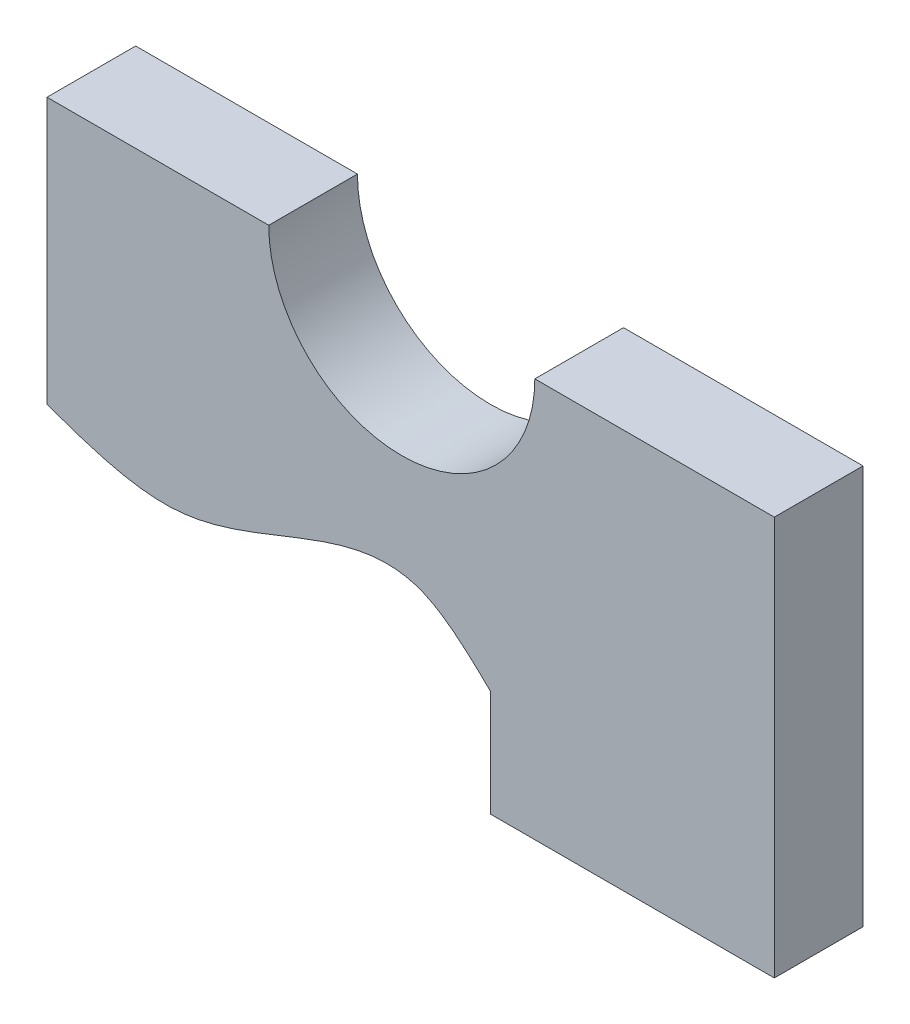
ISO-10303-21;
HEADER;
FILE_DESCRIPTION(('STEP AP214'),'2;1');
FILE_NAME('part.step','',(''),(''),'','','');
FILE_SCHEMA(('AUTOMOTIVE_DESIGN { 1 0 10303 214 1 1 1 1 }'));
ENDSEC;
DATA;
#1=APPLICATION_CONTEXT('core data for automotive mechanical design processes');
#2=APPLICATION_PROTOCOL_DEFINITION('international standard','automotive_design',2000,#1);
#3=PRODUCT_CONTEXT('',#1,'mechanical');
#4=PRODUCT('Part','Part','',(#3));
#5=PRODUCT_RELATED_PRODUCT_CATEGORY('part','',(#4));
#6=PRODUCT_DEFINITION_FORMATION('','',#4);
#7=PRODUCT_DEFINITION_CONTEXT('part definition',#1,'design');
#8=PRODUCT_DEFINITION('design','',#6,#7);
#9=PRODUCT_DEFINITION_SHAPE('','',#8);
#10=(LENGTH_UNIT() NAMED_UNIT(*) SI_UNIT(.MILLI.,.METRE.));
#11=(NAMED_UNIT(*) PLANE_ANGLE_UNIT() SI_UNIT($,.RADIAN.));
#12=(NAMED_UNIT(*) SI_UNIT($,.STERADIAN.) SOLID_ANGLE_UNIT());
#13=UNCERTAINTY_MEASURE_WITH_UNIT(LENGTH_MEASURE(1.E-05),#10,'distance_accuracy_value','');
#14=(GEOMETRIC_REPRESENTATION_CONTEXT(3) GLOBAL_UNCERTAINTY_ASSIGNED_CONTEXT((#13)) GLOBAL_UNIT_ASSIGNED_CONTEXT((#10,
#11,#12)) REPRESENTATION_CONTEXT('',''));
#15=CARTESIAN_POINT('',(0.,0.,0.));
#16=DIRECTION('',(0.,0.,1.));
#17=DIRECTION('',(1.,0.,0.));
#18=AXIS2_PLACEMENT_3D('',#15,#16,#17);
#19=CARTESIAN_POINT('',(0.,0.,10.));
#20=DIRECTION('',(1.,0.,0.));
#21=DIRECTION('',(0.,0.,-1.));
#22=AXIS2_PLACEMENT_3D('',#19,#20,#21);
#23=PLANE('',#22);
#24=DIRECTION('',(0.,-1.,0.));
#25=VECTOR('',#24,1.);
#26=CARTESIAN_POINT('',(0.,0.,0.));
#27=LINE('',#26,#25);
#28=CARTESIAN_POINT('',(0.,12.,0.));
#29=VERTEX_POINT('',#28);
#30=CARTESIAN_POINT('',(0.,0.,0.));
#31=VERTEX_POINT('',#30);
#32=EDGE_CURVE('E101',#29,#31,#27,.T.);
#33=ORIENTED_EDGE('',*,*,#32,.T.);
#34=DIRECTION('',(0.,0.,-1.));
#35=VECTOR('',#34,1.);
#36=CARTESIAN_POINT('',(0.,0.,10.));
#37=LINE('',#36,#35);
#38=CARTESIAN_POINT('',(0.,0.,10.));
#39=VERTEX_POINT('',#38);
#40=EDGE_CURVE('E11',#39,#31,#37,.T.);
#41=ORIENTED_EDGE('',*,*,#40,.F.);
#42=DIRECTION('',(0.,-1.,0.));
#43=VECTOR('',#42,1.);
#44=CARTESIAN_POINT('',(0.,0.,10.));
#45=LINE('',#44,#43);
#46=CARTESIAN_POINT('',(0.,12.,10.));
#47=VERTEX_POINT('',#46);
#48=EDGE_CURVE('E130',#47,#39,#45,.T.);
#49=ORIENTED_EDGE('',*,*,#48,.F.);
#50=DIRECTION('',(0.,0.,-1.));
#51=VECTOR('',#50,1.);
#52=CARTESIAN_POINT('',(0.,12.,10.));
#53=LINE('',#52,#51);
#54=EDGE_CURVE('E114',#47,#29,#53,.T.);
#55=ORIENTED_EDGE('',*,*,#54,.T.);
#56=EDGE_LOOP('',(#33,#41,#49,#55));
#57=FACE_BOUND('',#56,.T.);
#58=ADVANCED_FACE('F33',(#57),#23,.F.);
#59=CARTESIAN_POINT('',(0.,0.,10.));
#60=DIRECTION('',(0.,1.,0.));
#61=DIRECTION('',(0.,0.,1.));
#62=AXIS2_PLACEMENT_3D('',#59,#60,#61);
#63=PLANE('',#62);
#64=DIRECTION('',(1.,0.,0.));
#65=VECTOR('',#64,1.);
#66=CARTESIAN_POINT('',(0.,0.,0.));
#67=LINE('',#66,#65);
#68=CARTESIAN_POINT('',(32.,0.,0.));
#69=VERTEX_POINT('',#68);
#70=EDGE_CURVE('E97',#31,#69,#67,.T.);
#71=ORIENTED_EDGE('',*,*,#70,.T.);
#72=DIRECTION('',(0.,0.,-1.));
#73=VECTOR('',#72,1.);
#74=CARTESIAN_POINT('',(32.,0.,10.));
#75=LINE('',#74,#73);
#76=CARTESIAN_POINT('',(32.,0.,10.));
#77=VERTEX_POINT('',#76);
#78=EDGE_CURVE('E40',#77,#69,#75,.T.);
#79=ORIENTED_EDGE('',*,*,#78,.F.);
#80=DIRECTION('',(1.,0.,0.));
#81=VECTOR('',#80,1.);
#82=CARTESIAN_POINT('',(0.,0.,10.));
#83=LINE('',#82,#81);
#84=EDGE_CURVE('E110',#39,#77,#83,.T.);
#85=ORIENTED_EDGE('',*,*,#84,.F.);
#86=ORIENTED_EDGE('',*,*,#40,.T.);
#87=EDGE_LOOP('',(#71,#79,#85,#86));
#88=FACE_BOUND('',#87,.T.);
#89=ADVANCED_FACE('F109',(#88),#63,.F.);
#90=CARTESIAN_POINT('',(32.,45.,10.));
#91=DIRECTION('',(-1.,0.,0.));
#92=DIRECTION('',(0.,-1.,0.));
#93=AXIS2_PLACEMENT_3D('',#90,#91,#92);
#94=PLANE('',#93);
#95=DIRECTION('',(0.,1.,0.));
#96=VECTOR('',#95,1.);
#97=CARTESIAN_POINT('',(32.,45.,0.));
#98=LINE('',#97,#96);
#99=CARTESIAN_POINT('',(32.,45.,0.));
#100=VERTEX_POINT('',#99);
#101=EDGE_CURVE('E103',#69,#100,#98,.T.);
#102=ORIENTED_EDGE('',*,*,#101,.T.);
#103=DIRECTION('',(0.,0.,-1.));
#104=VECTOR('',#103,1.);
#105=CARTESIAN_POINT('',(32.,45.,10.));
#106=LINE('',#105,#104);
#107=CARTESIAN_POINT('',(32.,45.,10.));
#108=VERTEX_POINT('',#107);
#109=EDGE_CURVE('E246',#108,#100,#106,.T.);
#110=ORIENTED_EDGE('',*,*,#109,.F.);
#111=DIRECTION('',(0.,1.,0.));
#112=VECTOR('',#111,1.);
#113=CARTESIAN_POINT('',(32.,45.,10.));
#114=LINE('',#113,#112);
#115=EDGE_CURVE('E136',#77,#108,#114,.T.);
#116=ORIENTED_EDGE('',*,*,#115,.F.);
#117=ORIENTED_EDGE('',*,*,#78,.T.);
#118=EDGE_LOOP('',(#102,#110,#116,#117));
#119=FACE_BOUND('',#118,.T.);
#120=ADVANCED_FACE('F176',(#119),#94,.F.);
#121=CARTESIAN_POINT('',(4.99999999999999,45.,10.));
#122=DIRECTION('',(0.,-1.,0.));
#123=DIRECTION('',(0.,0.,-1.));
#124=AXIS2_PLACEMENT_3D('',#121,#122,#123);
#125=PLANE('',#124);
#126=DIRECTION('',(-1.,0.,0.));
#127=VECTOR('',#126,1.);
#128=CARTESIAN_POINT('',(4.99999999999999,45.,0.));
#129=LINE('',#128,#127);
#130=CARTESIAN_POINT('',(4.99999999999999,45.,0.));
#131=VERTEX_POINT('',#130);
#132=EDGE_CURVE('E118',#100,#131,#129,.T.);
#133=ORIENTED_EDGE('',*,*,#132,.T.);
#134=DIRECTION('',(0.,0.,-1.));
#135=VECTOR('',#134,1.);
#136=CARTESIAN_POINT('',(4.99999999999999,45.,10.));
#137=LINE('',#136,#135);
#138=CARTESIAN_POINT('',(4.99999999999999,45.,10.));
#139=VERTEX_POINT('',#138);
#140=EDGE_CURVE('E249',#139,#131,#137,.T.);
#141=ORIENTED_EDGE('',*,*,#140,.F.);
#142=DIRECTION('',(-1.,0.,0.));
#143=VECTOR('',#142,1.);
#144=CARTESIAN_POINT('',(4.99999999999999,45.,10.));
#145=LINE('',#144,#143);
#146=EDGE_CURVE('E138',#108,#139,#145,.T.);
#147=ORIENTED_EDGE('',*,*,#146,.F.);
#148=ORIENTED_EDGE('',*,*,#109,.T.);
#149=EDGE_LOOP('',(#133,#141,#147,#148));
#150=FACE_BOUND('',#149,.T.);
#151=ADVANCED_FACE('F172',(#150),#125,.F.);
#152=CARTESIAN_POINT('',(-10.,45.,10.));
#153=DIRECTION('',(0.,0.,-1.));
#154=DIRECTION('',(-1.,0.,0.));
#155=AXIS2_PLACEMENT_3D('',#152,#153,#154);
#156=CYLINDRICAL_SURFACE('',#155,15.);
#157=CARTESIAN_POINT('',(-10.,45.,0.));
#158=DIRECTION('',(0.,0.,-1.));
#159=DIRECTION('',(1.,0.,0.));
#160=AXIS2_PLACEMENT_3D('',#157,#158,#159);
#161=CIRCLE('',#160,15.);
#162=CARTESIAN_POINT('',(-25.,45.,0.));
#163=VERTEX_POINT('',#162);
#164=EDGE_CURVE('E120',#131,#163,#161,.T.);
#165=ORIENTED_EDGE('',*,*,#164,.T.);
#166=DIRECTION('',(0.,0.,-1.));
#167=VECTOR('',#166,1.);
#168=CARTESIAN_POINT('',(-25.,45.,10.));
#169=LINE('',#168,#167);
#170=CARTESIAN_POINT('',(-25.,45.,10.));
#171=VERTEX_POINT('',#170);
#172=EDGE_CURVE('E258',#171,#163,#169,.T.);
#173=ORIENTED_EDGE('',*,*,#172,.F.);
#174=CARTESIAN_POINT('',(-10.,45.,10.));
#175=DIRECTION('',(0.,0.,-1.));
#176=DIRECTION('',(1.,0.,0.));
#177=AXIS2_PLACEMENT_3D('',#174,#175,#176);
#178=CIRCLE('',#177,15.);
#179=EDGE_CURVE('E140',#139,#171,#178,.T.);
#180=ORIENTED_EDGE('',*,*,#179,.F.);
#181=ORIENTED_EDGE('',*,*,#140,.T.);
#182=EDGE_LOOP('',(#165,#173,#180,#181));
#183=FACE_BOUND('',#182,.T.);
#184=ADVANCED_FACE('F168',(#183),#156,.F.);
#185=CARTESIAN_POINT('',(-50.,45.,10.));
#186=DIRECTION('',(0.,-1.,0.));
#187=DIRECTION('',(0.,0.,-1.));
#188=AXIS2_PLACEMENT_3D('',#185,#186,#187);
#189=PLANE('',#188);
#190=DIRECTION('',(-1.,0.,0.));
#191=VECTOR('',#190,1.);
#192=CARTESIAN_POINT('',(-50.,45.,0.));
#193=LINE('',#192,#191);
#194=CARTESIAN_POINT('',(-50.,45.,0.));
#195=VERTEX_POINT('',#194);
#196=EDGE_CURVE('E122',#163,#195,#193,.T.);
#197=ORIENTED_EDGE('',*,*,#196,.T.);
#198=DIRECTION('',(0.,0.,-1.));
#199=VECTOR('',#198,1.);
#200=CARTESIAN_POINT('',(-50.,45.,10.));
#201=LINE('',#200,#199);
#202=CARTESIAN_POINT('',(-50.,45.,10.));
#203=VERTEX_POINT('',#202);
#204=EDGE_CURVE('E261',#203,#195,#201,.T.);
#205=ORIENTED_EDGE('',*,*,#204,.F.);
#206=DIRECTION('',(-1.,0.,0.));
#207=VECTOR('',#206,1.);
#208=CARTESIAN_POINT('',(-50.,45.,10.));
#209=LINE('',#208,#207);
#210=EDGE_CURVE('E142',#171,#203,#209,.T.);
#211=ORIENTED_EDGE('',*,*,#210,.F.);
#212=ORIENTED_EDGE('',*,*,#172,.T.);
#213=EDGE_LOOP('',(#197,#205,#211,#212));
#214=FACE_BOUND('',#213,.T.);
#215=ADVANCED_FACE('F164',(#214),#189,.F.);
#216=CARTESIAN_POINT('',(-50.,15.,10.));
#217=DIRECTION('',(1.,0.,0.));
#218=DIRECTION('',(0.,1.,0.));
#219=AXIS2_PLACEMENT_3D('',#216,#217,#218);
#220=PLANE('',#219);
#221=DIRECTION('',(0.,-1.,0.));
#222=VECTOR('',#221,1.);
#223=CARTESIAN_POINT('',(-50.,15.,0.));
#224=LINE('',#223,#222);
#225=CARTESIAN_POINT('',(-50.,15.,0.));
#226=VERTEX_POINT('',#225);
#227=EDGE_CURVE('E124',#195,#226,#224,.T.);
#228=ORIENTED_EDGE('',*,*,#227,.T.);
#229=DIRECTION('',(0.,0.,-1.));
#230=VECTOR('',#229,1.);
#231=CARTESIAN_POINT('',(-50.,15.,10.));
#232=LINE('',#231,#230);
#233=CARTESIAN_POINT('',(-50.,15.,10.));
#234=VERTEX_POINT('',#233);
#235=EDGE_CURVE('E265',#234,#226,#232,.T.);
#236=ORIENTED_EDGE('',*,*,#235,.F.);
#237=DIRECTION('',(0.,-1.,0.));
#238=VECTOR('',#237,1.);
#239=CARTESIAN_POINT('',(-50.,15.,10.));
#240=LINE('',#239,#238);
#241=EDGE_CURVE('E52',#203,#234,#240,.T.);
#242=ORIENTED_EDGE('',*,*,#241,.F.);
#243=ORIENTED_EDGE('',*,*,#204,.T.);
#244=EDGE_LOOP('',(#228,#236,#242,#243));
#245=FACE_BOUND('',#244,.T.);
#246=ADVANCED_FACE('F159',(#245),#220,.F.);
#247=CARTESIAN_POINT('',(-50.,15.,10.));
#248=CARTESIAN_POINT('',(-45.0620950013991,13.2658159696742,10.));
#249=CARTESIAN_POINT('',(-31.195956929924,8.39605131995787,10.));
#250=CARTESIAN_POINT('',(-12.2909054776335,23.8039476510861,10.));
#251=CARTESIAN_POINT('',(-2.57894627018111,14.4767700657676,10.));
#252=CARTESIAN_POINT('',(0.,12.,10.));
#253=B_SPLINE_CURVE_WITH_KNOTS('',3,(#247,#248,#249,#250,#251,#252),.UNSPECIFIED.,.F.,.F.,(4,1,
1,4),(0.,0.288865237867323,0.811162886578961,1.),.UNSPECIFIED.);
#254=DIRECTION('',(0.,0.,-1.));
#255=VECTOR('',#254,1.);
#256=SURFACE_OF_LINEAR_EXTRUSION('',#253,#255);
#257=CARTESIAN_POINT('',(-50.,15.,0.));
#258=CARTESIAN_POINT('',(-45.0620950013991,13.2658159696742,0.));
#259=CARTESIAN_POINT('',(-31.195956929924,8.39605131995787,0.));
#260=CARTESIAN_POINT('',(-12.2909054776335,23.8039476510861,0.));
#261=CARTESIAN_POINT('',(-2.57894627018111,14.4767700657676,0.));
#262=CARTESIAN_POINT('',(0.,12.,0.));
#263=B_SPLINE_CURVE_WITH_KNOTS('',3,(#257,#258,#259,#260,#261,#262),.UNSPECIFIED.,.F.,.F.,(4,1,
1,4),(0.,0.288865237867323,0.811162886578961,1.),.UNSPECIFIED.);
#264=EDGE_CURVE('E126',#226,#29,#263,.T.);
#265=ORIENTED_EDGE('',*,*,#264,.T.);
#266=ORIENTED_EDGE('',*,*,#54,.F.);
#267=EDGE_CURVE('E47',#234,#47,#253,.T.);
#268=ORIENTED_EDGE('',*,*,#267,.F.);
#269=ORIENTED_EDGE('',*,*,#235,.T.);
#270=EDGE_LOOP('',(#265,#266,#268,#269));
#271=FACE_BOUND('',#270,.T.);
#272=ADVANCED_FACE('F154',(#271),#256,.F.);
#273=CARTESIAN_POINT('',(-23.6386794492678,15.3585617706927,10.));
#274=DIRECTION('',(0.,0.,-1.));
#275=DIRECTION('',(-1.,0.,0.));
#276=AXIS2_PLACEMENT_3D('',#273,#274,#275);
#277=PLANE('',#276);
#278=ORIENTED_EDGE('',*,*,#48,.T.);
#279=ORIENTED_EDGE('',*,*,#84,.T.);
#280=ORIENTED_EDGE('',*,*,#115,.T.);
#281=ORIENTED_EDGE('',*,*,#146,.T.);
#282=ORIENTED_EDGE('',*,*,#179,.T.);
#283=ORIENTED_EDGE('',*,*,#210,.T.);
#284=ORIENTED_EDGE('',*,*,#241,.T.);
#285=ORIENTED_EDGE('',*,*,#267,.T.);
#286=EDGE_LOOP('',(#278,#279,#280,#281,#282,#283,#284,#285));
#287=FACE_BOUND('',#286,.T.);
#288=ADVANCED_FACE('F158',(#287),#277,.F.);
#289=CARTESIAN_POINT('',(-23.6386794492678,15.3585617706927,0.));
#290=DIRECTION('',(0.,0.,-1.));
#291=DIRECTION('',(-1.,0.,0.));
#292=AXIS2_PLACEMENT_3D('',#289,#290,#291);
#293=PLANE('',#292);
#294=ORIENTED_EDGE('',*,*,#32,.F.);
#295=ORIENTED_EDGE('',*,*,#264,.F.);
#296=ORIENTED_EDGE('',*,*,#227,.F.);
#297=ORIENTED_EDGE('',*,*,#196,.F.);
#298=ORIENTED_EDGE('',*,*,#164,.F.);
#299=ORIENTED_EDGE('',*,*,#132,.F.);
#300=ORIENTED_EDGE('',*,*,#101,.F.);
#301=ORIENTED_EDGE('',*,*,#70,.F.);
#302=EDGE_LOOP('',(#294,#295,#296,#297,#298,#299,#300,#301));
#303=FACE_BOUND('',#302,.T.);
#304=ADVANCED_FACE('F98',(#303),#293,.T.);
#305=CLOSED_SHELL('',(#58,#89,#120,#151,#184,#215,#246,#272,#288,#304));
#306=MANIFOLD_SOLID_BREP('B2',#305);
#307=ADVANCED_BREP_SHAPE_REPRESENTATION('',(#18,#306),#14);
#308=SHAPE_DEFINITION_REPRESENTATION(#9,#307);
ENDSEC;
END-ISO-10303-21;
